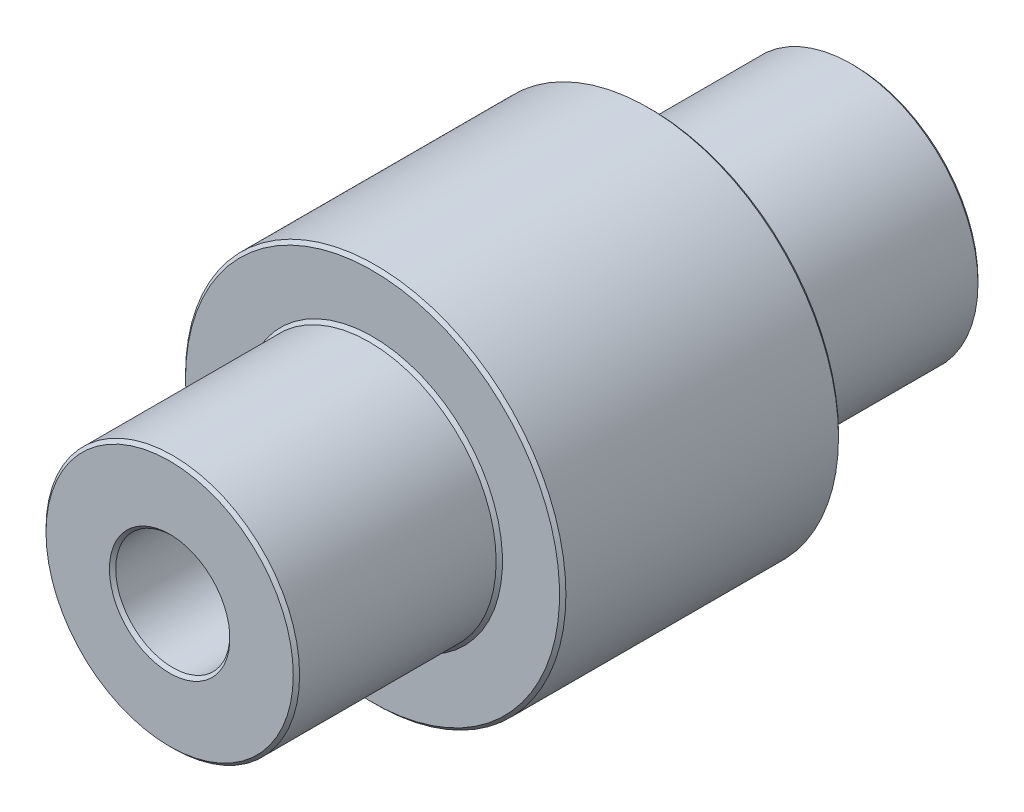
from build123d import *

# Parameters (mm, degrees)
CHAMFER_1_SIZE = 0.25


with BuildPart() as part:
    # Sketch 1 → Revolve 1 (revolve)
    with BuildSketch(Plane(origin=(0, 0, 0), x_dir=(0, 0, -1), z_dir=(1, 0, 0)), mode=Mode.PRIVATE) as revolve_1_sk:
        Polygon((-27, 4.5), (27, 4.5), (27, 10), (11, 10), (11, 15), (-11, 15), (-11, 10), (-27, 10), align=None)
    revolve(revolve_1_sk.sketch.rotate(Axis((0, 0, 27), (0, 0, -1)), 90), axis=Axis((0, 0, 27), (0, 0, -1)))

    # Chamfer 1
    chamfer_1_edges = [part.edges().sort_by_distance(p)[0] for p in [
        (-10, 0, 27),
        (-10, 0, 11),
        (-15, 0, 11),
        (-15, 0, -11),
        (-10, 0, -11),
        (-10, 0, -27),
        (-4.5, 0, -27),
        (-4.5, 0, 27),
    ]]
    chamfer(chamfer_1_edges, length=CHAMFER_1_SIZE)


solid = part.part
